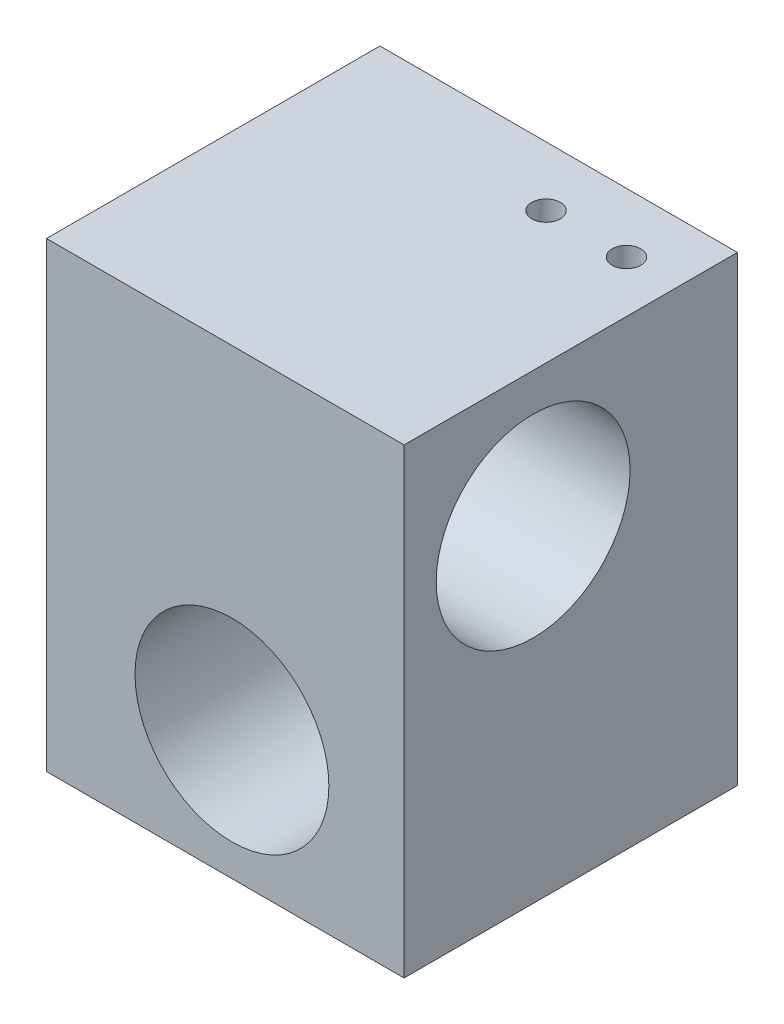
from build123d import *

# Parameters (mm, degrees)
SKETCH1_W                 = 25.4
SKETCH1_H                 = 25.4
BOSS_EXTRUDE1_DEPTH       = 28.7
SKETCH2_R                 = 6.0254
CUT_EXTRUDE1_DEPTH        = 41.969781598
SKETCH3_R                 = 6.025
CUT_EXTRUDE2_DEPTH        = 43.04456911
F_2_56_TAPPED_HOLE1_D     = 1.778
F_2_56_TAPPED_HOLE1_DEPTH = 6.6548
F_2_56_TAPPED_HOLE1_TIP   = 0.53416509
CUT_EXTRUDE3_DEPTH        = 37.500120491
F_2_56_TAPPED_HOLE2_D     = 1.778
F_2_56_TAPPED_HOLE2_DEPTH = 6.6548
F_2_56_TAPPED_HOLE2_TIP   = 0.53416509


with BuildPart() as part:
    # Sketch1 → Boss-Extrude1 (new body)
    with BuildSketch(Plane(origin=(0, 0, 0), x_dir=(1, 0, 0), z_dir=(0, 1, 0))):
        with Locations((1.780089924, 4.588602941)):
            Rectangle(SKETCH1_W, SKETCH1_H)
    extrude(amount=BOSS_EXTRUDE1_DEPTH)

    # Sketch2 → Cut-Extrude1 (cut, through all)
    with BuildSketch(Plane.XY.offset(8.111397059)):
        with Locations((3.780089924, 8)):
            Circle(SKETCH2_R)
    extrude(amount=-CUT_EXTRUDE1_DEPTH, mode=Mode.SUBTRACT)

    # Sketch3 → Cut-Extrude2 (cut, through all)
    with BuildSketch(Plane(origin=(14.480089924, 0, 0), x_dir=(0, 0, -1), z_dir=(1, 0, 0))):
        with Locations((4.588602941, 20.319)):
            Circle(SKETCH3_R)
    extrude(amount=-CUT_EXTRUDE2_DEPTH, mode=Mode.SUBTRACT)

    # 2-56 Tapped Hole1
    with Locations(Plane(origin=(0, 28.7, 0), x_dir=(1, 0, 0), z_dir=(0, 1, 0))):
        with Locations((6.280089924, 13.588602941), (11.280089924, 13.588602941)):
            Hole(F_2_56_TAPPED_HOLE1_D / 2, depth=F_2_56_TAPPED_HOLE1_DEPTH)
            with Locations((0, 0, -(F_2_56_TAPPED_HOLE1_DEPTH + F_2_56_TAPPED_HOLE1_TIP / 2))):  # 118° drill point
                Cone(0, F_2_56_TAPPED_HOLE1_D / 2, F_2_56_TAPPED_HOLE1_TIP, mode=Mode.SUBTRACT)

    # Sketch10 → Cut-Extrude3 (cut, through all)
    with BuildSketch(Plane(origin=(0, 28.7, 0), x_dir=(1, 0, 0), z_dir=(0, 1, 0))):
        Polygon((-7.744910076, -3.436397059), (14.480089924, -3.436397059), (14.480089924, -8.111397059), (-10.919910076, -8.111397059), (-10.919910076, 17.288602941), (-7.744910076, 17.288602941), align=None)
    extrude(amount=-CUT_EXTRUDE3_DEPTH, mode=Mode.SUBTRACT)

    # 2-56 Tapped Hole2
    with Locations(Plane(origin=(0, 0, 0), x_dir=(-1, 0, 0), z_dir=(0, -1, 0))):
        with Locations((3.934910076, 13.588602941), (3.934910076, 3.588602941)):
            Hole(F_2_56_TAPPED_HOLE2_D / 2, depth=F_2_56_TAPPED_HOLE2_DEPTH)
            with Locations((0, 0, -(F_2_56_TAPPED_HOLE2_DEPTH + F_2_56_TAPPED_HOLE2_TIP / 2))):  # 118° drill point
                Cone(0, F_2_56_TAPPED_HOLE2_D / 2, F_2_56_TAPPED_HOLE2_TIP, mode=Mode.SUBTRACT)


solid = part.part
